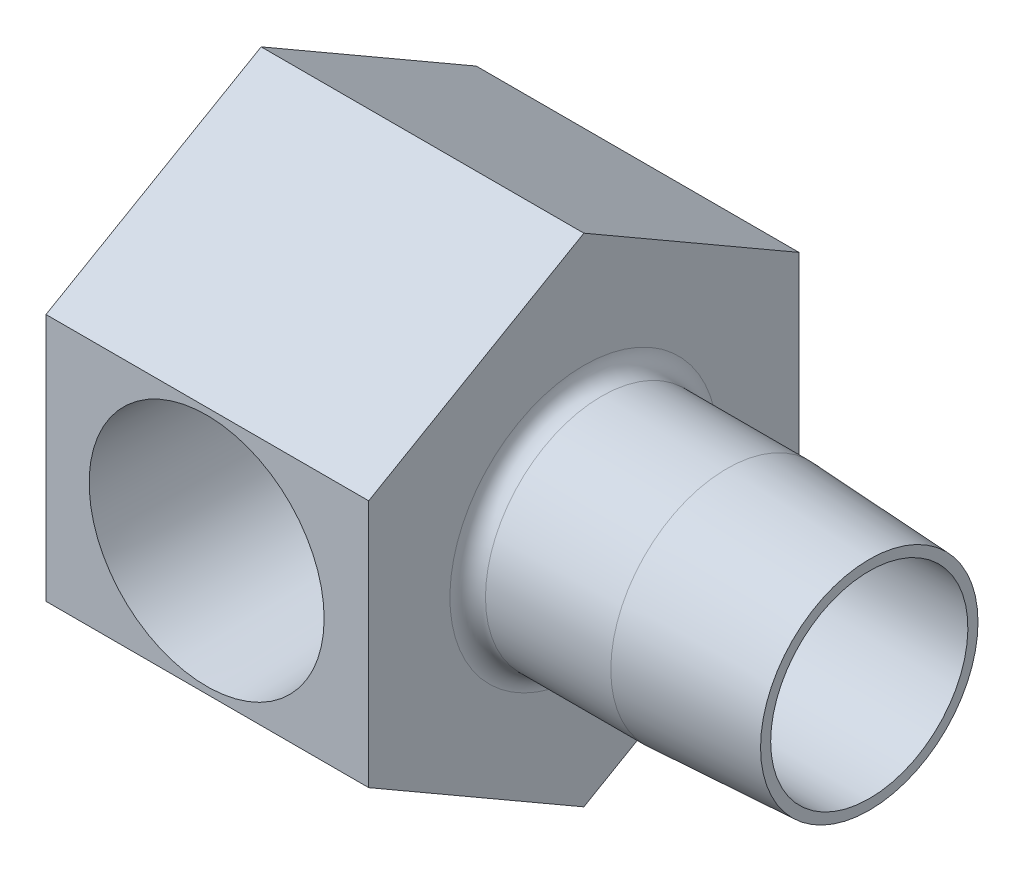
ISO-10303-21;
HEADER;
FILE_DESCRIPTION(('STEP AP214'),'2;1');
FILE_NAME('part.step','',(''),(''),'','','');
FILE_SCHEMA(('AUTOMOTIVE_DESIGN { 1 0 10303 214 1 1 1 1 }'));
ENDSEC;
DATA;
#1=APPLICATION_CONTEXT('core data for automotive mechanical design processes');
#2=APPLICATION_PROTOCOL_DEFINITION('international standard','automotive_design',2000,#1);
#3=PRODUCT_CONTEXT('',#1,'mechanical');
#4=PRODUCT('Part','Part','',(#3));
#5=PRODUCT_RELATED_PRODUCT_CATEGORY('part','',(#4));
#6=PRODUCT_DEFINITION_FORMATION('','',#4);
#7=PRODUCT_DEFINITION_CONTEXT('part definition',#1,'design');
#8=PRODUCT_DEFINITION('design','',#6,#7);
#9=PRODUCT_DEFINITION_SHAPE('','',#8);
#10=(LENGTH_UNIT() NAMED_UNIT(*) SI_UNIT(.MILLI.,.METRE.));
#11=(NAMED_UNIT(*) PLANE_ANGLE_UNIT() SI_UNIT($,.RADIAN.));
#12=(NAMED_UNIT(*) SI_UNIT($,.STERADIAN.) SOLID_ANGLE_UNIT());
#13=UNCERTAINTY_MEASURE_WITH_UNIT(LENGTH_MEASURE(1.E-05),#10,'distance_accuracy_value','');
#14=(GEOMETRIC_REPRESENTATION_CONTEXT(3) GLOBAL_UNCERTAINTY_ASSIGNED_CONTEXT((#13)) GLOBAL_UNIT_ASSIGNED_CONTEXT((#10,
#11,#12)) REPRESENTATION_CONTEXT('',''));
#15=CARTESIAN_POINT('',(0.,0.,0.));
#16=DIRECTION('',(0.,0.,1.));
#17=DIRECTION('',(1.,0.,0.));
#18=AXIS2_PLACEMENT_3D('',#15,#16,#17);
#19=CARTESIAN_POINT('',(6.30059133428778,0.,-4.81071060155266));
#20=DIRECTION('',(-1.,0.,0.));
#21=DIRECTION('',(0.,0.,1.));
#22=AXIS2_PLACEMENT_3D('',#19,#20,#21);
#23=PLANE('',#22);
#24=CARTESIAN_POINT('',(6.30059133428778,0.,0.));
#25=DIRECTION('',(-1.,0.,0.));
#26=DIRECTION('',(0.,0.,1.));
#27=AXIS2_PLACEMENT_3D('',#24,#25,#26);
#28=CIRCLE('',#27,4.365625);
#29=CARTESIAN_POINT('',(6.30059133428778,0.,4.365625));
#30=VERTEX_POINT('',#29);
#31=EDGE_CURVE('E17',#30,#30,#28,.F.);
#32=ORIENTED_EDGE('',*,*,#31,.F.);
#33=EDGE_LOOP('',(#32));
#34=FACE_BOUND('',#33,.T.);
#35=CARTESIAN_POINT('',(6.30059133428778,0.,0.));
#36=DIRECTION('',(1.,0.,0.));
#37=DIRECTION('',(0.,0.,-1.));
#38=AXIS2_PLACEMENT_3D('',#35,#36,#37);
#39=CIRCLE('',#38,4.8133);
#40=CARTESIAN_POINT('',(6.30059133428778,0.,-4.8133));
#41=VERTEX_POINT('',#40);
#42=EDGE_CURVE('E131',#41,#41,#39,.T.);
#43=ORIENTED_EDGE('',*,*,#42,.T.);
#44=EDGE_LOOP('',(#43));
#45=FACE_BOUND('',#44,.T.);
#46=ADVANCED_FACE('F14',(#34,#45),#23,.F.);
#47=CARTESIAN_POINT('',(47.3879923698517,0.,0.));
#48=DIRECTION('',(-1.,0.,0.));
#49=DIRECTION('',(0.,0.,1.));
#50=AXIS2_PLACEMENT_3D('',#47,#48,#49);
#51=CYLINDRICAL_SURFACE('',#50,5.1435);
#52=CARTESIAN_POINT('',(0.,0.,0.));
#53=DIRECTION('',(-1.,0.,0.));
#54=DIRECTION('',(0.,0.,1.));
#55=AXIS2_PLACEMENT_3D('',#52,#53,#54);
#56=CIRCLE('',#55,5.1435);
#57=CARTESIAN_POINT('',(0.,0.,5.1435));
#58=VERTEX_POINT('',#57);
#59=EDGE_CURVE('E133',#58,#58,#56,.T.);
#60=ORIENTED_EDGE('',*,*,#59,.T.);
#61=EDGE_LOOP('',(#60));
#62=FACE_BOUND('',#61,.T.);
#63=CARTESIAN_POINT('',(-5.54850866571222,0.,0.));
#64=DIRECTION('',(1.,0.,0.));
#65=DIRECTION('',(0.,1.,0.));
#66=AXIS2_PLACEMENT_3D('',#63,#64,#65);
#67=CIRCLE('',#66,5.1435);
#68=CARTESIAN_POINT('',(-5.54850866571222,5.1435,0.));
#69=VERTEX_POINT('',#68);
#70=EDGE_CURVE('E210',#69,#69,#67,.T.);
#71=ORIENTED_EDGE('',*,*,#70,.T.);
#72=EDGE_LOOP('',(#71));
#73=FACE_BOUND('',#72,.T.);
#74=ADVANCED_FACE('F117',(#62,#73),#51,.T.);
#75=CARTESIAN_POINT('',(-13.4796586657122,0.,0.));
#76=DIRECTION('',(1.,0.,0.));
#77=DIRECTION('',(0.,0.,-1.));
#78=AXIS2_PLACEMENT_3D('',#75,#76,#77);
#79=PLANE('',#78);
#80=DIRECTION('',(0.,0.,1.));
#81=VECTOR('',#80,1.);
#82=CARTESIAN_POINT('',(-13.4796586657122,4.21628045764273,9.525));
#83=LINE('',#82,#81);
#84=CARTESIAN_POINT('',(-13.4796586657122,4.21628045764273,-1.1321045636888));
#85=VERTEX_POINT('',#84);
#86=CARTESIAN_POINT('',(-13.4796586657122,4.21628045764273,0.635));
#87=VERTEX_POINT('',#86);
#88=EDGE_CURVE('E148',#85,#87,#83,.T.);
#89=ORIENTED_EDGE('',*,*,#88,.F.);
#90=CARTESIAN_POINT('',(-13.4796586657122,0.,0.));
#91=DIRECTION('',(1.,0.,0.));
#92=DIRECTION('',(0.,0.,-1.));
#93=AXIS2_PLACEMENT_3D('',#90,#91,#92);
#94=CIRCLE('',#93,4.365625);
#95=CARTESIAN_POINT('',(-13.4796586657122,4.31919629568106,0.635));
#96=VERTEX_POINT('',#95);
#97=EDGE_CURVE('E155',#85,#96,#94,.T.);
#98=ORIENTED_EDGE('',*,*,#97,.T.);
#99=DIRECTION('',(0.,1.,0.));
#100=VECTOR('',#99,1.);
#101=CARTESIAN_POINT('',(-13.4796586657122,0.,0.635));
#102=LINE('',#101,#100);
#103=EDGE_CURVE('E154',#87,#96,#102,.T.);
#104=ORIENTED_EDGE('',*,*,#103,.F.);
#105=EDGE_LOOP('',(#89,#98,#104));
#106=FACE_BOUND('',#105,.T.);
#107=ADVANCED_FACE('F123',(#106),#79,.T.);
#108=CARTESIAN_POINT('',(-6.33590866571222,5.4992613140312,9.525));
#109=DIRECTION('',(0.,0.,-1.));
#110=DIRECTION('',(-1.,0.,0.));
#111=AXIS2_PLACEMENT_3D('',#108,#109,#110);
#112=PLANE('',#111);
#113=CARTESIAN_POINT('',(-13.5114086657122,0.,9.525));
#114=DIRECTION('',(0.,0.,1.));
#115=DIRECTION('',(1.,0.,0.));
#116=AXIS2_PLACEMENT_3D('',#113,#114,#115);
#117=CIRCLE('',#116,5.2023645);
#118=CARTESIAN_POINT('',(-8.30904416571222,0.,9.525));
#119=VERTEX_POINT('',#118);
#120=EDGE_CURVE('E136',#119,#119,#117,.T.);
#121=ORIENTED_EDGE('',*,*,#120,.F.);
#122=EDGE_LOOP('',(#121));
#123=FACE_BOUND('',#122,.T.);
#124=DIRECTION('',(0.,-1.,0.));
#125=VECTOR('',#124,1.);
#126=CARTESIAN_POINT('',(-20.6234086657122,5.4992613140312,9.525));
#127=LINE('',#126,#125);
#128=CARTESIAN_POINT('',(-20.6234086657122,5.4992613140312,9.525));
#129=VERTEX_POINT('',#128);
#130=CARTESIAN_POINT('',(-20.6234086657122,-5.49926131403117,9.525));
#131=VERTEX_POINT('',#130);
#132=EDGE_CURVE('E169',#129,#131,#127,.T.);
#133=ORIENTED_EDGE('',*,*,#132,.T.);
#134=DIRECTION('',(-1.,0.,0.));
#135=VECTOR('',#134,1.);
#136=CARTESIAN_POINT('',(-6.33590866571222,-5.49926131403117,9.525));
#137=LINE('',#136,#135);
#138=CARTESIAN_POINT('',(-6.33590866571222,-5.49926131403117,9.525));
#139=VERTEX_POINT('',#138);
#140=EDGE_CURVE('E192',#139,#131,#137,.T.);
#141=ORIENTED_EDGE('',*,*,#140,.F.);
#142=DIRECTION('',(0.,-1.,0.));
#143=VECTOR('',#142,1.);
#144=CARTESIAN_POINT('',(-6.33590866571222,5.4992613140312,9.525));
#145=LINE('',#144,#143);
#146=CARTESIAN_POINT('',(-6.33590866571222,5.4992613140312,9.525));
#147=VERTEX_POINT('',#146);
#148=EDGE_CURVE('E185',#147,#139,#145,.T.);
#149=ORIENTED_EDGE('',*,*,#148,.F.);
#150=DIRECTION('',(-1.,0.,0.));
#151=VECTOR('',#150,1.);
#152=CARTESIAN_POINT('',(-6.33590866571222,5.4992613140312,9.525));
#153=LINE('',#152,#151);
#154=EDGE_CURVE('E195',#147,#129,#153,.T.);
#155=ORIENTED_EDGE('',*,*,#154,.T.);
#156=EDGE_LOOP('',(#133,#141,#149,#155));
#157=FACE_BOUND('',#156,.T.);
#158=ADVANCED_FACE('F260',(#123,#157),#112,.F.);
#159=CARTESIAN_POINT('',(-6.33590866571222,-5.49926131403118,-9.525));
#160=DIRECTION('',(1.,0.,0.));
#161=DIRECTION('',(0.,1.,0.));
#162=AXIS2_PLACEMENT_3D('',#159,#160,#161);
#163=PLANE('',#162);
#164=CARTESIAN_POINT('',(-6.33590866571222,0.,0.));
#165=DIRECTION('',(1.,0.,0.));
#166=DIRECTION('',(0.,1.,0.));
#167=AXIS2_PLACEMENT_3D('',#164,#165,#166);
#168=CIRCLE('',#167,5.9309);
#169=CARTESIAN_POINT('',(-6.33590866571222,5.9309,0.));
#170=VERTEX_POINT('',#169);
#171=EDGE_CURVE('E207',#170,#170,#168,.F.);
#172=ORIENTED_EDGE('',*,*,#171,.T.);
#173=EDGE_LOOP('',(#172));
#174=FACE_BOUND('',#173,.T.);
#175=DIRECTION('',(0.,0.5,-0.866025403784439));
#176=VECTOR('',#175,1.);
#177=CARTESIAN_POINT('',(-6.33590866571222,-10.9985226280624,0.));
#178=LINE('',#177,#176);
#179=CARTESIAN_POINT('',(-6.33590866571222,-10.9985226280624,0.));
#180=VERTEX_POINT('',#179);
#181=CARTESIAN_POINT('',(-6.33590866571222,-5.49926131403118,-9.525));
#182=VERTEX_POINT('',#181);
#183=EDGE_CURVE('E175',#180,#182,#178,.T.);
#184=ORIENTED_EDGE('',*,*,#183,.T.);
#185=DIRECTION('',(0.,1.,0.));
#186=VECTOR('',#185,1.);
#187=CARTESIAN_POINT('',(-6.33590866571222,-5.49926131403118,-9.525));
#188=LINE('',#187,#186);
#189=CARTESIAN_POINT('',(-6.33590866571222,5.49926131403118,-9.525));
#190=VERTEX_POINT('',#189);
#191=EDGE_CURVE('E179',#182,#190,#188,.T.);
#192=ORIENTED_EDGE('',*,*,#191,.T.);
#193=DIRECTION('',(0.,0.5,0.866025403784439));
#194=VECTOR('',#193,1.);
#195=CARTESIAN_POINT('',(-6.33590866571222,5.49926131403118,-9.525));
#196=LINE('',#195,#194);
#197=CARTESIAN_POINT('',(-6.33590866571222,10.9985226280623,0.));
#198=VERTEX_POINT('',#197);
#199=EDGE_CURVE('E181',#190,#198,#196,.T.);
#200=ORIENTED_EDGE('',*,*,#199,.T.);
#201=DIRECTION('',(0.,-0.5,0.86602540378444));
#202=VECTOR('',#201,1.);
#203=CARTESIAN_POINT('',(-6.33590866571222,10.9985226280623,0.));
#204=LINE('',#203,#202);
#205=EDGE_CURVE('E183',#198,#147,#204,.T.);
#206=ORIENTED_EDGE('',*,*,#205,.T.);
#207=ORIENTED_EDGE('',*,*,#148,.T.);
#208=DIRECTION('',(0.,-0.5,-0.866025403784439));
#209=VECTOR('',#208,1.);
#210=CARTESIAN_POINT('',(-6.33590866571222,-5.49926131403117,9.525));
#211=LINE('',#210,#209);
#212=EDGE_CURVE('E37',#139,#180,#211,.T.);
#213=ORIENTED_EDGE('',*,*,#212,.T.);
#214=EDGE_LOOP('',(#184,#192,#200,#206,#207,#213));
#215=FACE_BOUND('',#214,.T.);
#216=ADVANCED_FACE('F257',(#174,#215),#163,.T.);
#217=CARTESIAN_POINT('',(-6.33590866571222,-10.9985226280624,0.));
#218=DIRECTION('',(0.,0.866025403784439,0.5));
#219=DIRECTION('',(0.,-0.5,0.866025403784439));
#220=AXIS2_PLACEMENT_3D('',#217,#218,#219);
#221=PLANE('',#220);
#222=DIRECTION('',(0.,0.5,-0.866025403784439));
#223=VECTOR('',#222,1.);
#224=CARTESIAN_POINT('',(-20.6234086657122,-10.9985226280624,0.));
#225=LINE('',#224,#223);
#226=CARTESIAN_POINT('',(-20.6234086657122,-10.9985226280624,0.));
#227=VERTEX_POINT('',#226);
#228=CARTESIAN_POINT('',(-20.6234086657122,-5.49926131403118,-9.525));
#229=VERTEX_POINT('',#228);
#230=EDGE_CURVE('E158',#227,#229,#225,.T.);
#231=ORIENTED_EDGE('',*,*,#230,.T.);
#232=DIRECTION('',(-1.,0.,0.));
#233=VECTOR('',#232,1.);
#234=CARTESIAN_POINT('',(-6.33590866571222,-5.49926131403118,-9.525));
#235=LINE('',#234,#233);
#236=EDGE_CURVE('E204',#182,#229,#235,.T.);
#237=ORIENTED_EDGE('',*,*,#236,.F.);
#238=ORIENTED_EDGE('',*,*,#183,.F.);
#239=DIRECTION('',(-1.,0.,0.));
#240=VECTOR('',#239,1.);
#241=CARTESIAN_POINT('',(-6.33590866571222,-10.9985226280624,0.));
#242=LINE('',#241,#240);
#243=EDGE_CURVE('E188',#180,#227,#242,.T.);
#244=ORIENTED_EDGE('',*,*,#243,.T.);
#245=EDGE_LOOP('',(#231,#237,#238,#244));
#246=FACE_BOUND('',#245,.T.);
#247=ADVANCED_FACE('F259',(#246),#221,.F.);
#248=CARTESIAN_POINT('',(-6.33590866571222,-5.49926131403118,-9.525));
#249=DIRECTION('',(0.,0.,1.));
#250=DIRECTION('',(0.,-1.,0.));
#251=AXIS2_PLACEMENT_3D('',#248,#249,#250);
#252=PLANE('',#251);
#253=DIRECTION('',(0.,1.,0.));
#254=VECTOR('',#253,1.);
#255=CARTESIAN_POINT('',(-20.6234086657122,-5.49926131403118,-9.525));
#256=LINE('',#255,#254);
#257=CARTESIAN_POINT('',(-20.6234086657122,5.49926131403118,-9.525));
#258=VERTEX_POINT('',#257);
#259=EDGE_CURVE('E160',#229,#258,#256,.T.);
#260=ORIENTED_EDGE('',*,*,#259,.T.);
#261=DIRECTION('',(-1.,0.,0.));
#262=VECTOR('',#261,1.);
#263=CARTESIAN_POINT('',(-6.33590866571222,5.49926131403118,-9.525));
#264=LINE('',#263,#262);
#265=EDGE_CURVE('E201',#190,#258,#264,.T.);
#266=ORIENTED_EDGE('',*,*,#265,.F.);
#267=ORIENTED_EDGE('',*,*,#191,.F.);
#268=ORIENTED_EDGE('',*,*,#236,.T.);
#269=EDGE_LOOP('',(#260,#266,#267,#268));
#270=FACE_BOUND('',#269,.T.);
#271=ADVANCED_FACE('F268',(#270),#252,.F.);
#272=CARTESIAN_POINT('',(-6.33590866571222,5.49926131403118,-9.525));
#273=DIRECTION('',(0.,-0.866025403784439,0.5));
#274=DIRECTION('',(0.,-0.5,-0.866025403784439));
#275=AXIS2_PLACEMENT_3D('',#272,#273,#274);
#276=PLANE('',#275);
#277=DIRECTION('',(0.,0.5,0.866025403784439));
#278=VECTOR('',#277,1.);
#279=CARTESIAN_POINT('',(-20.6234086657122,5.49926131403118,-9.525));
#280=LINE('',#279,#278);
#281=CARTESIAN_POINT('',(-20.6234086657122,10.9985226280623,0.));
#282=VERTEX_POINT('',#281);
#283=EDGE_CURVE('E163',#258,#282,#280,.T.);
#284=ORIENTED_EDGE('',*,*,#283,.T.);
#285=DIRECTION('',(-1.,0.,0.));
#286=VECTOR('',#285,1.);
#287=CARTESIAN_POINT('',(-6.33590866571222,10.9985226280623,0.));
#288=LINE('',#287,#286);
#289=EDGE_CURVE('E198',#198,#282,#288,.T.);
#290=ORIENTED_EDGE('',*,*,#289,.F.);
#291=ORIENTED_EDGE('',*,*,#199,.F.);
#292=ORIENTED_EDGE('',*,*,#265,.T.);
#293=EDGE_LOOP('',(#284,#290,#291,#292));
#294=FACE_BOUND('',#293,.T.);
#295=ADVANCED_FACE('F273',(#294),#276,.F.);
#296=CARTESIAN_POINT('',(-6.33590866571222,10.9985226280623,0.));
#297=DIRECTION('',(0.,-0.86602540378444,-0.5));
#298=DIRECTION('',(0.,0.5,-0.86602540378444));
#299=AXIS2_PLACEMENT_3D('',#296,#297,#298);
#300=PLANE('',#299);
#301=DIRECTION('',(0.,-0.5,0.86602540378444));
#302=VECTOR('',#301,1.);
#303=CARTESIAN_POINT('',(-20.6234086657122,10.9985226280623,0.));
#304=LINE('',#303,#302);
#305=EDGE_CURVE('E166',#282,#129,#304,.T.);
#306=ORIENTED_EDGE('',*,*,#305,.T.);
#307=ORIENTED_EDGE('',*,*,#154,.F.);
#308=ORIENTED_EDGE('',*,*,#205,.F.);
#309=ORIENTED_EDGE('',*,*,#289,.T.);
#310=EDGE_LOOP('',(#306,#307,#308,#309));
#311=FACE_BOUND('',#310,.T.);
#312=ADVANCED_FACE('F279',(#311),#300,.F.);
#313=CARTESIAN_POINT('',(-6.33590866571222,-5.49926131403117,9.525));
#314=DIRECTION('',(0.,0.866025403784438,-0.5));
#315=DIRECTION('',(0.,0.5,0.866025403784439));
#316=AXIS2_PLACEMENT_3D('',#313,#314,#315);
#317=PLANE('',#316);
#318=DIRECTION('',(0.,-0.5,-0.866025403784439));
#319=VECTOR('',#318,1.);
#320=CARTESIAN_POINT('',(-20.6234086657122,-5.49926131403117,9.525));
#321=LINE('',#320,#319);
#322=EDGE_CURVE('E172',#131,#227,#321,.T.);
#323=ORIENTED_EDGE('',*,*,#322,.T.);
#324=ORIENTED_EDGE('',*,*,#243,.F.);
#325=ORIENTED_EDGE('',*,*,#212,.F.);
#326=ORIENTED_EDGE('',*,*,#140,.T.);
#327=EDGE_LOOP('',(#323,#324,#325,#326));
#328=FACE_BOUND('',#327,.T.);
#329=ADVANCED_FACE('F285',(#328),#317,.F.);
#330=CARTESIAN_POINT('',(-20.6234086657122,-5.49926131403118,-9.525));
#331=DIRECTION('',(1.,0.,0.));
#332=DIRECTION('',(0.,1.,0.));
#333=AXIS2_PLACEMENT_3D('',#330,#331,#332);
#334=PLANE('',#333);
#335=ORIENTED_EDGE('',*,*,#230,.F.);
#336=ORIENTED_EDGE('',*,*,#322,.F.);
#337=ORIENTED_EDGE('',*,*,#132,.F.);
#338=ORIENTED_EDGE('',*,*,#305,.F.);
#339=ORIENTED_EDGE('',*,*,#283,.F.);
#340=ORIENTED_EDGE('',*,*,#259,.F.);
#341=EDGE_LOOP('',(#335,#336,#337,#338,#339,#340));
#342=FACE_BOUND('',#341,.T.);
#343=ADVANCED_FACE('F287',(#342),#334,.F.);
#344=CARTESIAN_POINT('',(-13.4796586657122,-4.31919629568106,0.635));
#345=VERTEX_POINT('',#344);
#346=CARTESIAN_POINT('',(-13.4796586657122,-4.21628045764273,0.635));
#347=VERTEX_POINT('',#346);
#348=EDGE_CURVE('E152',#345,#347,#102,.T.);
#349=ORIENTED_EDGE('',*,*,#348,.F.);
#350=CARTESIAN_POINT('',(-13.4796586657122,-4.21628045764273,-1.1321045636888));
#351=VERTEX_POINT('',#350);
#352=EDGE_CURVE('E159',#345,#351,#94,.T.);
#353=ORIENTED_EDGE('',*,*,#352,.T.);
#354=DIRECTION('',(0.,0.,1.));
#355=VECTOR('',#354,1.);
#356=CARTESIAN_POINT('',(-13.4796586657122,-4.21628045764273,9.525));
#357=LINE('',#356,#355);
#358=EDGE_CURVE('E150',#347,#351,#357,.F.);
#359=ORIENTED_EDGE('',*,*,#358,.F.);
#360=EDGE_LOOP('',(#349,#353,#359));
#361=FACE_BOUND('',#360,.T.);
#362=ADVANCED_FACE('F289',(#361),#79,.T.);
#363=CARTESIAN_POINT('',(45.5141000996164,0.,0.));
#364=DIRECTION('',(1.,0.,0.));
#365=DIRECTION('',(0.,0.,-1.));
#366=AXIS2_PLACEMENT_3D('',#363,#364,#365);
#367=CYLINDRICAL_SURFACE('',#366,4.365625);
#368=DIRECTION('',(1.,0.,0.));
#369=VECTOR('',#368,1.);
#370=CARTESIAN_POINT('',(45.5141000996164,4.31919629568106,0.635));
#371=LINE('',#370,#369);
#372=CARTESIAN_POINT('',(-11.1217485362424,4.31919629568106,0.635));
#373=VERTEX_POINT('',#372);
#374=EDGE_CURVE('E9',#96,#373,#371,.T.);
#375=ORIENTED_EDGE('',*,*,#374,.F.);
#376=ORIENTED_EDGE('',*,*,#97,.F.);
#377=CARTESIAN_POINT('',(-9.60814806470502,1.5945487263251,-4.064));
#378=CARTESIAN_POINT('',(-9.65431759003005,1.7075595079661,-4.01965833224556));
#379=CARTESIAN_POINT('',(-9.70476313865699,1.81703423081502,-3.97126660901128));
#380=CARTESIAN_POINT('',(-9.81310646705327,2.02846645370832,-3.86753757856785));
#381=CARTESIAN_POINT('',(-9.87098945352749,2.13043826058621,-3.81221406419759));
#382=CARTESIAN_POINT('',(-10.0535181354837,2.42358040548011,-3.63817255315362));
#383=CARTESIAN_POINT('',(-10.1877769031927,2.60370246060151,-3.51067632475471));
#384=CARTESIAN_POINT('',(-10.4229360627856,2.87382153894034,-3.28913090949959));
#385=CARTESIAN_POINT('',(-10.5182801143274,2.97281573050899,-3.19971678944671));
#386=CARTESIAN_POINT('',(-10.7155743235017,3.15907014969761,-3.0159651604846));
#387=CARTESIAN_POINT('',(-10.8175259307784,3.2463277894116,-2.92162657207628));
#388=CARTESIAN_POINT('',(-11.0272727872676,3.40951469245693,-2.72943416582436));
#389=CARTESIAN_POINT('',(-11.1350751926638,3.48542963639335,-2.63157609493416));
#390=CARTESIAN_POINT('',(-11.3559498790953,3.62617881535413,-2.43396946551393));
#391=CARTESIAN_POINT('',(-11.4690204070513,3.69101670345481,-2.33422154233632));
#392=CARTESIAN_POINT('',(-11.7064075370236,3.81296593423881,-2.12952179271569));
#393=CARTESIAN_POINT('',(-11.8310036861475,3.86952009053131,-2.02456211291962));
#394=CARTESIAN_POINT('',(-12.0875329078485,3.97111492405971,-1.81720426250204));
#395=CARTESIAN_POINT('',(-12.2194853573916,4.01612325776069,-1.71481399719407));
#396=CARTESIAN_POINT('',(-12.4603613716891,4.0847277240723,-1.54273309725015));
#397=CARTESIAN_POINT('',(-12.5671305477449,4.11086974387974,-1.47112541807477));
#398=CARTESIAN_POINT('',(-12.7331334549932,4.14432560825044,-1.37275496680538));
#399=CARTESIAN_POINT('',(-12.7891529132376,4.15448196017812,-1.34160310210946));
#400=CARTESIAN_POINT('',(-12.903650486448,4.17277321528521,-1.28357266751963));
#401=CARTESIAN_POINT('',(-12.9621268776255,4.18090950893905,-1.25669116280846));
#402=CARTESIAN_POINT('',(-13.0940900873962,4.19631734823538,-1.20437143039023));
#403=CARTESIAN_POINT('',(-13.1682279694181,4.2030846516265,-1.18031441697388));
#404=CARTESIAN_POINT('',(-13.3210661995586,4.21282137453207,-1.14503512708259));
#405=CARTESIAN_POINT('',(-13.3998255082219,4.21571837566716,-1.13405798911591));
#406=CARTESIAN_POINT('',(-13.4796586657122,4.21628045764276,-1.13210456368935));
#407=B_SPLINE_CURVE_WITH_KNOTS('',3,(#377,#378,#379,#380,#381,#382,#383,#384,#385,#386,#387,
#388,#389,#390,#391,#392,#393,#394,#395,#396,#397,#398,#399,#400,#401,#402,#403,#404,#405,#406),
.UNSPECIFIED.,.F.,.F.,(4,2,2,2,2,2,2,2,2,2,2,2,2,2,4),(0.,0.389178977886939,0.777595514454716,
1.54850925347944,2.03989074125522,2.5313804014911,3.02348538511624,3.51542776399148,
4.03226982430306,4.55054429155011,4.94339994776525,5.13792303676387,5.33231185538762,
5.56585330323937,5.80370611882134),.UNSPECIFIED.);
#408=CARTESIAN_POINT('',(-9.60814806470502,1.5945487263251,-4.064));
#409=VERTEX_POINT('',#408);
#410=EDGE_CURVE('E213',#409,#85,#407,.T.);
#411=ORIENTED_EDGE('',*,*,#410,.F.);
#412=CARTESIAN_POINT('',(-9.58479996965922,-1.66986531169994,-4.0336375));
#413=CARTESIAN_POINT('',(-9.6128732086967,-1.5831922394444,-4.06955268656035));
#414=CARTESIAN_POINT('',(-9.63742873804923,-1.49442111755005,-4.102996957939));
#415=CARTESIAN_POINT('',(-9.6802877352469,-1.31365154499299,-4.16437594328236));
#416=CARTESIAN_POINT('',(-9.69859912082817,-1.22165734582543,-4.19231761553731));
#417=CARTESIAN_POINT('',(-9.72980272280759,-1.03529168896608,-4.24218933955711));
#418=CARTESIAN_POINT('',(-9.74270109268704,-0.940923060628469,-4.26412620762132));
#419=CARTESIAN_POINT('',(-9.76400005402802,-0.750424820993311,-4.30174029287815));
#420=CARTESIAN_POINT('',(-9.77239918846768,-0.654294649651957,-4.3174154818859));
#421=CARTESIAN_POINT('',(-9.7852670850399,-0.463156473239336,-4.34203220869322));
#422=CARTESIAN_POINT('',(-9.78982087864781,-0.368172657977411,-4.3511187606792));
#423=CARTESIAN_POINT('',(-9.79575279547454,-0.177678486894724,-4.36305205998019));
#424=CARTESIAN_POINT('',(-9.79712961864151,-0.0821679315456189,-4.36589625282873));
#425=CARTESIAN_POINT('',(-9.79684441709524,0.108822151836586,-4.36531306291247));
#426=CARTESIAN_POINT('',(-9.79518262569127,0.204301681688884,-4.36188616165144));
#427=CARTESIAN_POINT('',(-9.78865287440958,0.3946850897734,-4.34879357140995));
#428=CARTESIAN_POINT('',(-9.78378625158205,0.489589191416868,-4.33913048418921));
#429=CARTESIAN_POINT('',(-9.77038623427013,0.678329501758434,-4.3136547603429));
#430=CARTESIAN_POINT('',(-9.76185226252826,0.772165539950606,-4.29784115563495));
#431=CARTESIAN_POINT('',(-9.74043088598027,0.958108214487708,-4.26024737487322));
#432=CARTESIAN_POINT('',(-9.72754488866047,1.05021539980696,-4.23846912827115));
#433=CARTESIAN_POINT('',(-9.69656923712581,1.23213175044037,-4.18920065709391));
#434=CARTESIAN_POINT('',(-9.67847362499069,1.32193815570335,-4.16170390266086));
#435=CARTESIAN_POINT('',(-9.63630923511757,1.49845562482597,-4.10147379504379));
#436=CARTESIAN_POINT('',(-9.61223318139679,1.58516276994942,-4.06873408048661));
#437=CARTESIAN_POINT('',(-9.58479996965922,1.66986531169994,-4.0336375));
#438=B_SPLINE_CURVE_WITH_KNOTS('',3,(#412,#413,#414,#415,#416,#417,#418,#419,#420,#421,#422,
#423,#424,#425,#426,#427,#428,#429,#430,#431,#432,#433,#434,#435,#436,#437),.UNSPECIFIED.,.F.,
.F.,(4,2,2,2,2,2,2,2,2,2,2,2,4),(0.,0.293591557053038,0.586809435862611,0.879693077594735,
1.17267150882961,1.45898777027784,1.74542117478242,2.03183258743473,2.31812458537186,
2.60446166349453,2.89070622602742,3.17727945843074,3.46420306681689),.UNSPECIFIED.);
#439=CARTESIAN_POINT('',(-9.60814806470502,-1.5945487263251,-4.064));
#440=VERTEX_POINT('',#439);
#441=EDGE_CURVE('E219',#440,#409,#438,.T.);
#442=ORIENTED_EDGE('',*,*,#441,.F.);
#443=CARTESIAN_POINT('',(-13.4796586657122,-4.21628045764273,-1.1321045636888));
#444=CARTESIAN_POINT('',(-13.439784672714,-4.21598583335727,-1.13318193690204));
#445=CARTESIAN_POINT('',(-13.4000266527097,-4.21511517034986,-1.13644339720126));
#446=CARTESIAN_POINT('',(-13.3211989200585,-4.21229002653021,-1.1468805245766));
#447=CARTESIAN_POINT('',(-13.282127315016,-4.21033927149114,-1.15404273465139));
#448=CARTESIAN_POINT('',(-13.1678227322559,-4.20306181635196,-1.18036903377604));
#449=CARTESIAN_POINT('',(-13.0938186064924,-4.19629141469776,-1.20445712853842));
#450=CARTESIAN_POINT('',(-12.945477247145,-4.17895935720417,-1.2633157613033));
#451=CARTESIAN_POINT('',(-12.8714068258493,-4.16818767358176,-1.29865861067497));
#452=CARTESIAN_POINT('',(-12.7270578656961,-4.14345087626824,-1.37554990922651));
#453=CARTESIAN_POINT('',(-12.6567858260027,-4.12948049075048,-1.41710856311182));
#454=CARTESIAN_POINT('',(-12.5181489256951,-4.09836535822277,-1.50475384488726));
#455=CARTESIAN_POINT('',(-12.4498376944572,-4.08117012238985,-1.55090608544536));
#456=CARTESIAN_POINT('',(-12.3157103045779,-4.04390532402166,-1.64563510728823));
#457=CARTESIAN_POINT('',(-12.2498952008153,-4.02383456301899,-1.69421289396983));
#458=CARTESIAN_POINT('',(-12.0448119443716,-3.95588469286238,-1.85017075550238));
#459=CARTESIAN_POINT('',(-11.9092281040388,-3.90283307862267,-1.96017133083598));
#460=CARTESIAN_POINT('',(-11.6449933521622,-3.7835808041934,-2.18153947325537));
#461=CARTESIAN_POINT('',(-11.5163493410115,-3.71736735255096,-2.29290827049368));
#462=CARTESIAN_POINT('',(-11.2663495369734,-3.57190642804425,-2.51346407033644));
#463=CARTESIAN_POINT('',(-11.1449526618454,-3.49274436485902,-2.62266043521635));
#464=CARTESIAN_POINT('',(-10.9090246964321,-3.32067953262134,-2.83737448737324));
#465=CARTESIAN_POINT('',(-10.7944887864,-3.22778657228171,-2.94289473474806));
#466=CARTESIAN_POINT('',(-10.5264641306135,-2.98549279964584,-3.1917246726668));
#467=CARTESIAN_POINT('',(-10.3768761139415,-2.82876640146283,-3.33224172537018));
#468=CARTESIAN_POINT('',(-10.0982846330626,-2.48539491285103,-3.59555859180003));
#469=CARTESIAN_POINT('',(-9.96922137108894,-2.29884003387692,-3.71840977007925));
#470=CARTESIAN_POINT('',(-9.80834414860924,-2.01834728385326,-3.87210052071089));
#471=CARTESIAN_POINT('',(-9.76495607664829,-1.93670806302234,-3.91362000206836));
#472=CARTESIAN_POINT('',(-9.68288505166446,-1.76894321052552,-3.99225599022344));
#473=CARTESIAN_POINT('',(-9.64420709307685,-1.6828129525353,-4.02936782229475));
#474=CARTESIAN_POINT('',(-9.60814806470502,-1.5945487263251,-4.064));
#475=B_SPLINE_CURVE_WITH_KNOTS('',3,(#443,#444,#445,#446,#447,#448,#449,#450,#451,#452,#453,
#454,#455,#456,#457,#458,#459,#460,#461,#462,#463,#464,#465,#466,#467,#468,#469,#470,#471,#472,
#473,#474),.UNSPECIFIED.,.F.,.F.,(4,2,2,2,2,2,2,2,2,2,2,2,2,2,2,4),(0.,0.119524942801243,
0.238640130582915,0.471907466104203,0.719716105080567,0.967936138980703,1.22042765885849,
1.47302472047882,2.01967972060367,2.56686861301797,3.1105838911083,3.65391262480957,
4.4259772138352,5.19574951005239,5.49953103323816,5.80363192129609),.UNSPECIFIED.);
#476=EDGE_CURVE('E230',#351,#440,#475,.T.);
#477=ORIENTED_EDGE('',*,*,#476,.F.);
#478=ORIENTED_EDGE('',*,*,#352,.F.);
#479=DIRECTION('',(1.,0.,0.));
#480=VECTOR('',#479,1.);
#481=CARTESIAN_POINT('',(45.5141000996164,-4.31919629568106,0.635));
#482=LINE('',#481,#480);
#483=CARTESIAN_POINT('',(-11.1217485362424,-4.31919629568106,0.635));
#484=VERTEX_POINT('',#483);
#485=EDGE_CURVE('E22',#484,#345,#482,.F.);
#486=ORIENTED_EDGE('',*,*,#485,.F.);
#487=CARTESIAN_POINT('',(-11.121814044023,4.31922569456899,0.6348));
#488=CARTESIAN_POINT('',(-11.1013539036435,4.31004461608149,0.697254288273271));
#489=CARTESIAN_POINT('',(-11.0789998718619,4.29961032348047,0.758851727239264));
#490=CARTESIAN_POINT('',(-11.0311640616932,4.27639816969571,0.880295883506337));
#491=CARTESIAN_POINT('',(-11.0056856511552,4.26362282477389,0.940144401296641));
#492=CARTESIAN_POINT('',(-10.9257001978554,4.22211002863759,1.11672048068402));
#493=CARTESIAN_POINT('',(-10.8674634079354,4.19010742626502,1.2309937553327));
#494=CARTESIAN_POINT('',(-10.7449617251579,4.11827910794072,1.45330127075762));
#495=CARTESIAN_POINT('',(-10.6807070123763,4.07846648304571,1.56134556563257));
#496=CARTESIAN_POINT('',(-10.5485363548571,3.9913538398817,1.77223006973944));
#497=CARTESIAN_POINT('',(-10.4806156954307,3.94404402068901,1.87506323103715));
#498=CARTESIAN_POINT('',(-10.3246340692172,3.82856370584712,2.1026502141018));
#499=CARTESIAN_POINT('',(-10.2360381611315,3.75819622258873,2.22592490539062));
#500=CARTESIAN_POINT('',(-10.0587410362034,3.60591330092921,2.4649830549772));
#501=CARTESIAN_POINT('',(-9.97003983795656,3.52399966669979,2.58076767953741));
#502=CARTESIAN_POINT('',(-9.79450561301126,3.34837324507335,2.80488150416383));
#503=CARTESIAN_POINT('',(-9.70767482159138,3.25464716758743,2.91320209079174));
#504=CARTESIAN_POINT('',(-9.53792964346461,3.05533823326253,3.12159788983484));
#505=CARTESIAN_POINT('',(-9.45501395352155,2.94975936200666,3.22167585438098));
#506=CARTESIAN_POINT('',(-9.25967883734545,2.67738871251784,3.45470779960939));
#507=CARTESIAN_POINT('',(-9.15031070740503,2.50408908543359,3.58277694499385));
#508=CARTESIAN_POINT('',(-8.94973020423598,2.13317678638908,3.81522902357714));
#509=CARTESIAN_POINT('',(-8.85847778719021,1.93561933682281,3.91966427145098));
#510=CARTESIAN_POINT('',(-8.71415229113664,1.55445058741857,4.08381750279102));
#511=CARTESIAN_POINT('',(-8.65720519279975,1.37434002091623,4.14814604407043));
#512=CARTESIAN_POINT('',(-8.58713291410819,1.09545803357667,4.22705949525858));
#513=CARTESIAN_POINT('',(-8.56632879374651,1.00100886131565,4.25043936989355));
#514=CARTESIAN_POINT('',(-8.53021253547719,0.80976989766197,4.29097777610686));
#515=CARTESIAN_POINT('',(-8.51489810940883,0.712981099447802,4.3081388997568));
#516=CARTESIAN_POINT('',(-8.49000705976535,0.517219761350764,4.33601130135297));
#517=CARTESIAN_POINT('',(-8.4804610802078,0.41823840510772,4.34668813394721));
#518=CARTESIAN_POINT('',(-8.46744154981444,0.219418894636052,4.3612461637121));
#519=CARTESIAN_POINT('',(-8.46396547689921,0.119581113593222,4.36513018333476));
#520=CARTESIAN_POINT('',(-8.46315966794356,-0.0801622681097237,4.36603083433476));
#521=CARTESIAN_POINT('',(-8.46583031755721,-0.180067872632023,4.3630470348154));
#522=CARTESIAN_POINT('',(-8.47724764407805,-0.379063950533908,4.35028173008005));
#523=CARTESIAN_POINT('',(-8.48599404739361,-0.478154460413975,4.34050053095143));
#524=CARTESIAN_POINT('',(-8.51925856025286,-0.757548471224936,4.30326253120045));
#525=CARTESIAN_POINT('',(-8.55085474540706,-0.93604823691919,4.26785833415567));
#526=CARTESIAN_POINT('',(-8.63195762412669,-1.28332325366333,4.17661422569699));
#527=CARTESIAN_POINT('',(-8.68146971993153,-1.45209555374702,4.12076815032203));
#528=CARTESIAN_POINT('',(-8.79999253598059,-1.78986703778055,3.98630209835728));
#529=CARTESIAN_POINT('',(-8.87021998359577,-1.95786359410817,3.90624902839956));
#530=CARTESIAN_POINT('',(-9.02434702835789,-2.2774775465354,3.72897277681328));
#531=CARTESIAN_POINT('',(-9.10824784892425,-2.42909347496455,3.6317480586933));
#532=CARTESIAN_POINT('',(-9.3340247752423,-2.79222476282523,3.36693649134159));
#533=CARTESIAN_POINT('',(-9.48289338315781,-2.99235864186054,3.18954438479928));
#534=CARTESIAN_POINT('',(-9.71570371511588,-3.26312100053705,2.9031267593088));
#535=CARTESIAN_POINT('',(-9.79516252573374,-3.34869576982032,2.80391408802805));
#536=CARTESIAN_POINT('',(-9.95577609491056,-3.51003537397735,2.5990974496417));
#537=CARTESIAN_POINT('',(-10.0369301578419,-3.58580414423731,2.49349607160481));
#538=CARTESIAN_POINT('',(-10.2013782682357,-3.72941202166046,2.27330060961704));
#539=CARTESIAN_POINT('',(-10.2846746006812,-3.79700254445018,2.15854677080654));
#540=CARTESIAN_POINT('',(-10.4493270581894,-3.92201333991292,1.92208067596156));
#541=CARTESIAN_POINT('',(-10.5306813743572,-3.97942442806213,1.8003622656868));
#542=CARTESIAN_POINT('',(-10.6877264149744,-4.083242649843,1.55047749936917));
#543=CARTESIAN_POINT('',(-10.7634604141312,-4.12974154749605,1.42237677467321));
#544=CARTESIAN_POINT('',(-10.9056110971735,-4.21155620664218,1.15783224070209));
#545=CARTESIAN_POINT('',(-10.9720494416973,-4.24689821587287,1.02140892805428));
#546=CARTESIAN_POINT('',(-11.0471274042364,-4.28419371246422,0.840262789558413));
#547=CARTESIAN_POINT('',(-11.0631213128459,-4.29194911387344,0.799736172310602));
#548=CARTESIAN_POINT('',(-11.0936346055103,-4.30640007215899,0.717866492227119));
#549=CARTESIAN_POINT('',(-11.1081514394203,-4.31309380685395,0.676522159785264));
#550=CARTESIAN_POINT('',(-11.121814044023,-4.31922569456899,0.6348));
#551=B_SPLINE_CURVE_WITH_KNOTS('',3,(#487,#488,#489,#490,#491,#492,#493,#494,#495,#496,#497,
#498,#499,#500,#501,#502,#503,#504,#505,#506,#507,#508,#509,#510,#511,#512,#513,#514,#515,#516,
#517,#518,#519,#520,#521,#522,#523,#524,#525,#526,#527,#528,#529,#530,#531,#532,#533,#534,#535,
#536,#537,#538,#539,#540,#541,#542,#543,#544,#545,#546,#547,#548,#549,#550),.UNSPECIFIED.,.F.,
.F.,(4,2,2,2,2,2,2,2,2,2,2,2,2,2,2,2,2,2,2,2,2,2,2,2,2,2,2,2,2,2,2,4),(0.,0.198955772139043,
0.397698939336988,0.79354238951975,1.18872791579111,1.58443438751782,2.08580736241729,
2.58710208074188,3.08896592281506,3.59066151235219,4.3128774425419,5.03347872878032,
5.62940645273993,5.92758657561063,6.22564226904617,6.52526772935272,6.82476866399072,
7.12428839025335,7.4237946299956,7.97525228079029,8.52687635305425,9.12138980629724,
9.71595648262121,10.6287987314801,11.0881817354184,11.5473798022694,12.018174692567,
12.4893922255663,12.9564924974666,13.4224855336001,13.5552077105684,13.6881552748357),.UNSPECIFIED.);
#552=EDGE_CURVE('E235',#373,#484,#551,.T.);
#553=ORIENTED_EDGE('',*,*,#552,.F.);
#554=EDGE_LOOP('',(#375,#376,#411,#442,#477,#478,#486,#553));
#555=FACE_BOUND('',#554,.T.);
#556=ORIENTED_EDGE('',*,*,#31,.T.);
#557=EDGE_LOOP('',(#556));
#558=FACE_BOUND('',#557,.T.);
#559=ADVANCED_FACE('F112',(#555,#558),#367,.F.);
#560=CARTESIAN_POINT('',(-5.54850866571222,0.,0.));
#561=DIRECTION('',(1.,0.,0.));
#562=DIRECTION('',(0.,1.,0.));
#563=AXIS2_PLACEMENT_3D('',#560,#561,#562);
#564=TOROIDAL_SURFACE('',#563,5.9309,0.7874);
#565=ORIENTED_EDGE('',*,*,#70,.F.);
#566=EDGE_LOOP('',(#565));
#567=FACE_BOUND('',#566,.T.);
#568=ORIENTED_EDGE('',*,*,#171,.F.);
#569=EDGE_LOOP('',(#568));
#570=FACE_BOUND('',#569,.T.);
#571=ADVANCED_FACE('F101',(#567,#570),#564,.F.);
#572=CARTESIAN_POINT('',(-13.5114086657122,0.,-4.064));
#573=DIRECTION('',(0.,0.,1.));
#574=DIRECTION('',(1.,0.,0.));
#575=AXIS2_PLACEMENT_3D('',#572,#573,#574);
#576=CONICAL_SURFACE('',#575,4.2164,1.02974425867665);
#577=ORIENTED_EDGE('',*,*,#441,.T.);
#578=CARTESIAN_POINT('',(-13.5114086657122,0.,-4.064));
#579=DIRECTION('',(0.,0.,1.));
#580=DIRECTION('',(1.,0.,0.));
#581=AXIS2_PLACEMENT_3D('',#578,#579,#580);
#582=CIRCLE('',#581,4.2164);
#583=EDGE_CURVE('E29',#409,#440,#582,.T.);
#584=ORIENTED_EDGE('',*,*,#583,.T.);
#585=EDGE_LOOP('',(#577,#584));
#586=FACE_BOUND('',#585,.T.);
#587=CARTESIAN_POINT('',(-13.5114086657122,0.,-6.59746871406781));
#588=VERTEX_POINT('',#587);
#589=VERTEX_LOOP('',#588);
#590=FACE_BOUND('',#589,.T.);
#591=ADVANCED_FACE('F98',(#586,#590),#576,.F.);
#592=CARTESIAN_POINT('',(-13.5114086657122,0.,9.525));
#593=DIRECTION('',(0.,0.,1.));
#594=DIRECTION('',(1.,0.,0.));
#595=AXIS2_PLACEMENT_3D('',#592,#593,#594);
#596=CYLINDRICAL_SURFACE('',#595,4.2164);
#597=ORIENTED_EDGE('',*,*,#358,.T.);
#598=ORIENTED_EDGE('',*,*,#476,.T.);
#599=ORIENTED_EDGE('',*,*,#583,.F.);
#600=ORIENTED_EDGE('',*,*,#410,.T.);
#601=ORIENTED_EDGE('',*,*,#88,.T.);
#602=CARTESIAN_POINT('',(-13.5114086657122,0.,0.635));
#603=DIRECTION('',(0.,0.,1.));
#604=DIRECTION('',(1.,0.,0.));
#605=AXIS2_PLACEMENT_3D('',#602,#603,#604);
#606=CIRCLE('',#605,4.2164);
#607=EDGE_CURVE('E144',#87,#347,#606,.T.);
#608=ORIENTED_EDGE('',*,*,#607,.T.);
#609=EDGE_LOOP('',(#597,#598,#599,#600,#601,#608));
#610=FACE_BOUND('',#609,.T.);
#611=ADVANCED_FACE('F100',(#610),#596,.F.);
#612=CARTESIAN_POINT('',(-9.29500866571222,0.,0.635));
#613=DIRECTION('',(0.,0.,-1.));
#614=DIRECTION('',(-1.,0.,0.));
#615=AXIS2_PLACEMENT_3D('',#612,#613,#614);
#616=PLANE('',#615);
#617=ORIENTED_EDGE('',*,*,#103,.T.);
#618=ORIENTED_EDGE('',*,*,#374,.T.);
#619=CARTESIAN_POINT('',(-13.5114086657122,0.,0.635));
#620=DIRECTION('',(0.,0.,1.));
#621=DIRECTION('',(1.,0.,0.));
#622=AXIS2_PLACEMENT_3D('',#619,#620,#621);
#623=CIRCLE('',#622,4.93618599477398);
#624=EDGE_CURVE('E141',#373,#484,#623,.T.);
#625=ORIENTED_EDGE('',*,*,#624,.T.);
#626=ORIENTED_EDGE('',*,*,#485,.T.);
#627=ORIENTED_EDGE('',*,*,#348,.T.);
#628=ORIENTED_EDGE('',*,*,#607,.F.);
#629=EDGE_LOOP('',(#617,#618,#625,#626,#627,#628));
#630=FACE_BOUND('',#629,.T.);
#631=ADVANCED_FACE('F110',(#630),#616,.F.);
#632=CARTESIAN_POINT('',(-13.5114086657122,0.,9.525));
#633=DIRECTION('',(0.,0.,1.));
#634=DIRECTION('',(1.,0.,0.));
#635=AXIS2_PLACEMENT_3D('',#632,#633,#634);
#636=CONICAL_SURFACE('',#635,5.2023645,0.0299323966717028);
#637=ORIENTED_EDGE('',*,*,#552,.T.);
#638=ORIENTED_EDGE('',*,*,#624,.F.);
#639=EDGE_LOOP('',(#637,#638));
#640=FACE_BOUND('',#639,.T.);
#641=ORIENTED_EDGE('',*,*,#120,.T.);
#642=EDGE_LOOP('',(#641));
#643=FACE_BOUND('',#642,.T.);
#644=ADVANCED_FACE('F240',(#640,#643),#636,.F.);
#645=CARTESIAN_POINT('',(-0.0494086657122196,0.,0.));
#646=DIRECTION('',(-1.,0.,0.));
#647=DIRECTION('',(0.,0.,1.));
#648=AXIS2_PLACEMENT_3D('',#645,#646,#647);
#649=CONICAL_SURFACE('',#648,5.14608939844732,0.0523598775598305);
#650=ORIENTED_EDGE('',*,*,#42,.F.);
#651=EDGE_LOOP('',(#650));
#652=FACE_BOUND('',#651,.T.);
#653=ORIENTED_EDGE('',*,*,#59,.F.);
#654=EDGE_LOOP('',(#653));
#655=FACE_BOUND('',#654,.T.);
#656=ADVANCED_FACE('F244',(#652,#655),#649,.T.);
#657=CLOSED_SHELL('',(#46,#74,#107,#158,#216,#247,#271,#295,#312,#329,#343,#362,#559,#571,#591,
#611,#631,#644,#656));
#658=MANIFOLD_SOLID_BREP('B1',#657);
#659=ADVANCED_BREP_SHAPE_REPRESENTATION('',(#18,#658),#14);
#660=SHAPE_DEFINITION_REPRESENTATION(#9,#659);
ENDSEC;
END-ISO-10303-21;
